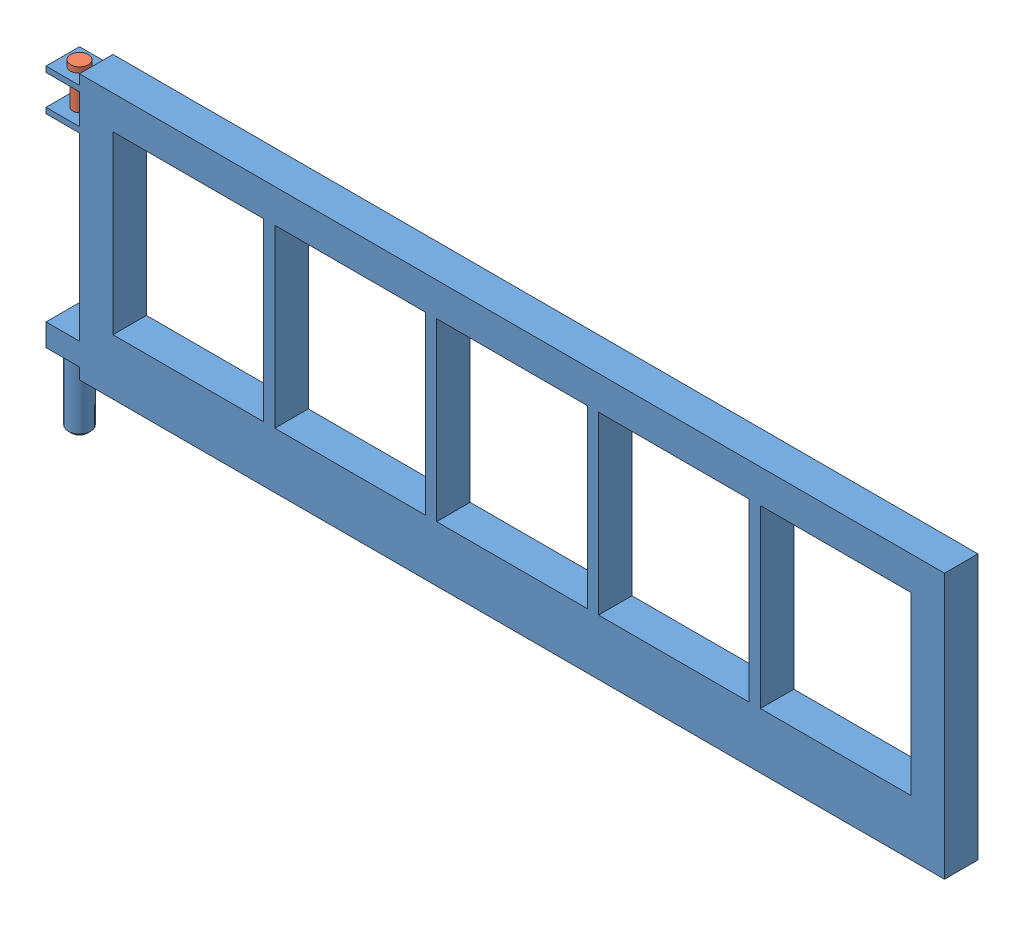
SolidWorks assembly ensemble vantail.SLDASM, configuration Défaut (file format 8000). Lengths in mm.
Overall size (805 290 30.01).
2 component instances, 2 part files, 2 mates.
Components (placement in the parent):
- vantail-1: vantail.SLDPRT [Défaut] at origin size (805 290 30.01)
- axe vantail-1: axe vantail.SLDPRT [Défaut] at (-115 118.5 15) x (0 -1 0) z (0 0 1) size (45 16 16)
Mates (geometry in assembly coordinates):
- Coïncidente5: coincident anti-aligned: plane of vantail-1 through (-130 158.5 30) normal (0 1 0); plane of axe vantail-1 through (-107 158.5 15) normal (0 -1 0)
- Coaxial2: concentric aligned: cylinder of vantail-1 through (-115 -70 15) axis (0 1 0) radius 6; cylinder of axe vantail-1 through (-115 208.5 15) axis (0 1 0) radius 6
